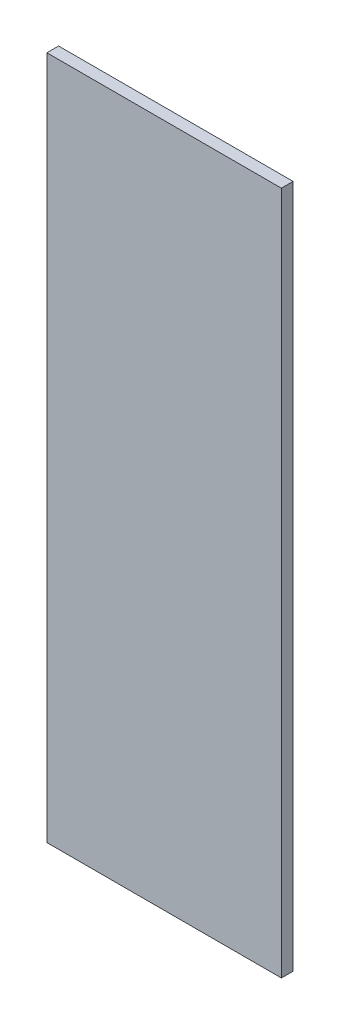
from build123d import *

# Parameters (mm, degrees)
SKETCH1_W           = 60
SKETCH1_H           = 175
BOSS_EXTRUDE1_DEPTH = 3


with BuildPart() as part:
    # Sketch1 → Boss-Extrude1 (new body)
    with BuildSketch(Plane.XY):
        Rectangle(SKETCH1_W, SKETCH1_H)
    extrude(amount=BOSS_EXTRUDE1_DEPTH)


solid = part.part
